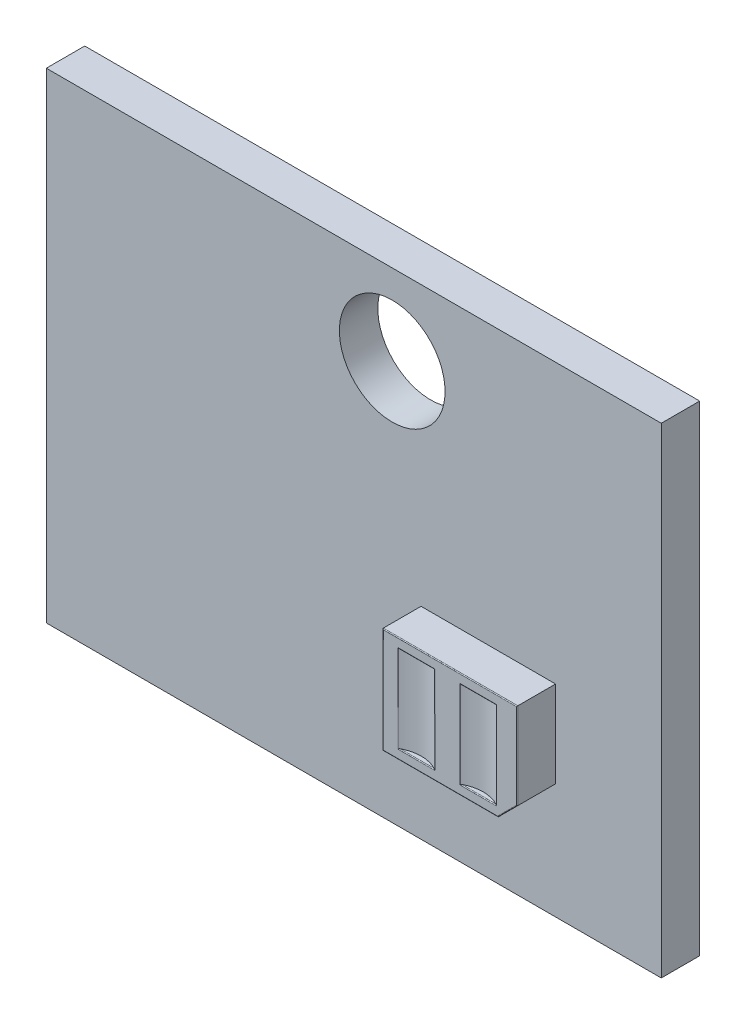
from build123d import *

# Parameters (mm, degrees)
ESQUISSE1_W             = 16
ESQUISSE1_H             = 12.5
ESQUISSE1_R             = 1.375
EXTRUSION1_DEPTH        = 1
EXTRUSION2_DEPTH        = 2
ENL_V_MAT_EXTRU_1_DEPTH = 2.25
CONG_1_R                = 0.02


with BuildPart() as part:
    # Esquisse1 → Extrusion1 (new body)
    with BuildSketch(Plane.XY):
        with Locations((-0.25, 0)):
            Rectangle(ESQUISSE1_W, ESQUISSE1_H)
        with Locations((0.75, 4.15)):
            Circle(ESQUISSE1_R, mode=Mode.SUBTRACT)
    extrude(amount=EXTRUSION1_DEPTH)

    # Esquisse3 → Extrusion2 (add)
    with BuildSketch(Plane.XY):
        Polygon((1.5, -1), (5, -1), (5, -3.25), (4.5, -3.75), (1.5, -3.75), align=None)
    extrude(amount=EXTRUSION2_DEPTH)

    # Esquisse4 → Enl_v. mat.-Extru.1 (cut)
    with BuildSketch(Plane.XZ.offset(3.5)):
        with BuildLine():
            Line((1.905461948, 2), (2.855665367, 2))
            ThreePointArc((2.855665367, 2), (2.380563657, 1.872882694), (1.905461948, 2))
        make_face()
        with BuildLine():
            Line((4.463762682, 2), (3.513559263, 2))
            ThreePointArc((3.513559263, 2), (3.988660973, 1.872882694), (4.463762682, 2))
        make_face()
    extrude(amount=-ENL_V_MAT_EXTRU_1_DEPTH, mode=Mode.SUBTRACT)

    # Cong_1
    cong_1_edges = [part.edges().sort_by_distance(p)[0] for p in [
        (3.25, -1, 2),
        (5, -2.125, 2),
        (4.75, -3.5, 2),
        (3, -3.75, 2),
        (1.5, -2.375, 2),
        (3.988660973, -3.5, 2),
        (3.513559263, -2.375, 2),
        (3.988660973, -1.25, 2),
        (4.463762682, -2.375, 2),
        (1.905461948, -2.375, 2),
        (2.380563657, -1.25, 2),
        (2.855665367, -2.375, 2),
        (2.380563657, -3.5, 2),
    ]]
    fillet(cong_1_edges, radius=CONG_1_R)


solid = part.part
